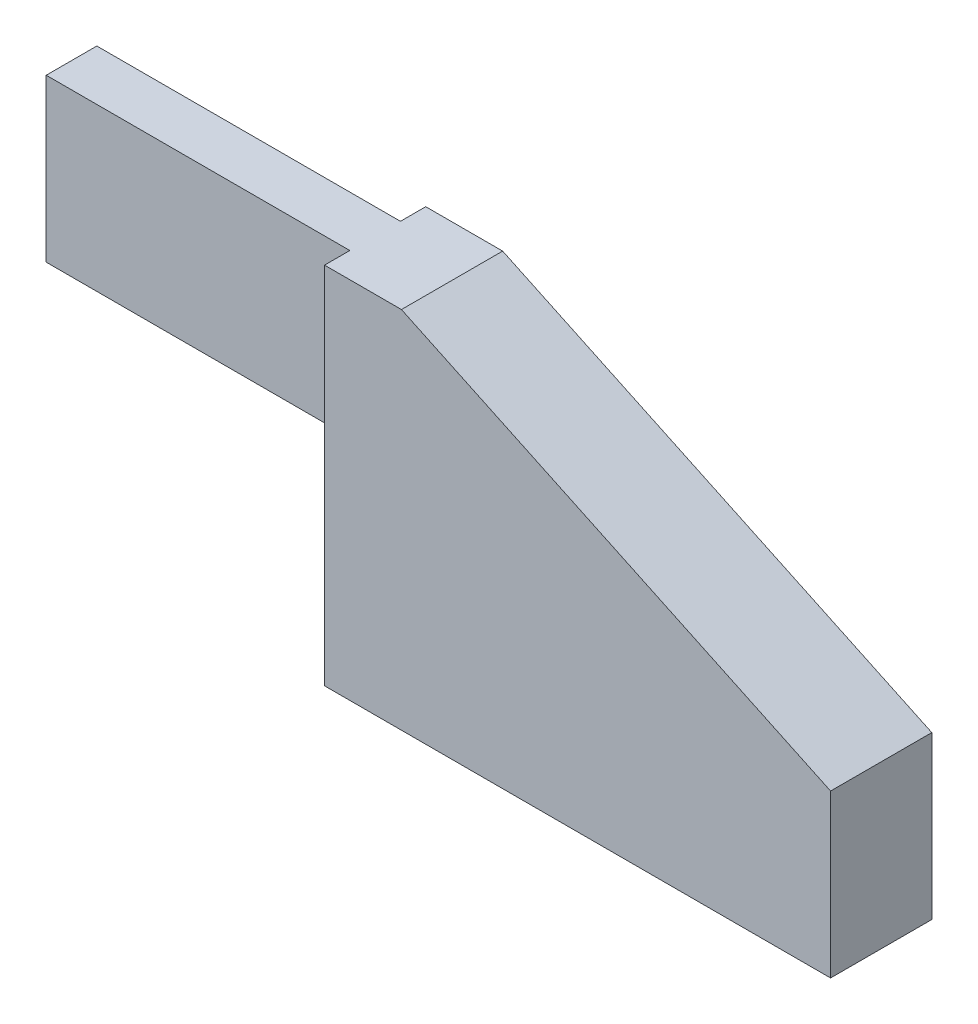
ISO-10303-21;
HEADER;
FILE_DESCRIPTION(('STEP AP214'),'2;1');
FILE_NAME('part.step','',(''),(''),'','','');
FILE_SCHEMA(('AUTOMOTIVE_DESIGN { 1 0 10303 214 1 1 1 1 }'));
ENDSEC;
DATA;
#1=APPLICATION_CONTEXT('core data for automotive mechanical design processes');
#2=APPLICATION_PROTOCOL_DEFINITION('international standard','automotive_design',2000,#1);
#3=PRODUCT_CONTEXT('',#1,'mechanical');
#4=PRODUCT('Part','Part','',(#3));
#5=PRODUCT_RELATED_PRODUCT_CATEGORY('part','',(#4));
#6=PRODUCT_DEFINITION_FORMATION('','',#4);
#7=PRODUCT_DEFINITION_CONTEXT('part definition',#1,'design');
#8=PRODUCT_DEFINITION('design','',#6,#7);
#9=PRODUCT_DEFINITION_SHAPE('','',#8);
#10=(LENGTH_UNIT() NAMED_UNIT(*) SI_UNIT(.MILLI.,.METRE.));
#11=(NAMED_UNIT(*) PLANE_ANGLE_UNIT() SI_UNIT($,.RADIAN.));
#12=(NAMED_UNIT(*) SI_UNIT($,.STERADIAN.) SOLID_ANGLE_UNIT());
#13=UNCERTAINTY_MEASURE_WITH_UNIT(LENGTH_MEASURE(1.E-05),#10,'distance_accuracy_value','');
#14=(GEOMETRIC_REPRESENTATION_CONTEXT(3) GLOBAL_UNCERTAINTY_ASSIGNED_CONTEXT((#13)) GLOBAL_UNIT_ASSIGNED_CONTEXT((#10,
#11,#12)) REPRESENTATION_CONTEXT('',''));
#15=CARTESIAN_POINT('',(0.,0.,0.));
#16=DIRECTION('',(0.,0.,1.));
#17=DIRECTION('',(1.,0.,0.));
#18=AXIS2_PLACEMENT_3D('',#15,#16,#17);
#19=CARTESIAN_POINT('',(0.,20.32,12.7));
#20=DIRECTION('',(-1.,0.,0.));
#21=DIRECTION('',(0.,-1.,0.));
#22=AXIS2_PLACEMENT_3D('',#19,#20,#21);
#23=PLANE('',#22);
#24=DIRECTION('',(0.,1.,0.));
#25=VECTOR('',#24,1.);
#26=CARTESIAN_POINT('',(0.,20.32,0.));
#27=LINE('',#26,#25);
#28=CARTESIAN_POINT('',(0.,0.,0.));
#29=VERTEX_POINT('',#28);
#30=CARTESIAN_POINT('',(0.,20.32,0.));
#31=VERTEX_POINT('',#30);
#32=EDGE_CURVE('E152',#29,#31,#27,.T.);
#33=ORIENTED_EDGE('',*,*,#32,.T.);
#34=DIRECTION('',(0.,0.,-1.));
#35=VECTOR('',#34,1.);
#36=CARTESIAN_POINT('',(0.,20.32,12.7));
#37=LINE('',#36,#35);
#38=CARTESIAN_POINT('',(0.,20.32,12.7));
#39=VERTEX_POINT('',#38);
#40=EDGE_CURVE('E11',#39,#31,#37,.T.);
#41=ORIENTED_EDGE('',*,*,#40,.F.);
#42=DIRECTION('',(0.,1.,0.));
#43=VECTOR('',#42,1.);
#44=CARTESIAN_POINT('',(0.,20.32,12.7));
#45=LINE('',#44,#43);
#46=CARTESIAN_POINT('',(0.,0.,12.7));
#47=VERTEX_POINT('',#46);
#48=EDGE_CURVE('E154',#47,#39,#45,.T.);
#49=ORIENTED_EDGE('',*,*,#48,.F.);
#50=DIRECTION('',(0.,0.,-1.));
#51=VECTOR('',#50,1.);
#52=CARTESIAN_POINT('',(0.,0.,12.7));
#53=LINE('',#52,#51);
#54=EDGE_CURVE('E163',#47,#29,#53,.T.);
#55=ORIENTED_EDGE('',*,*,#54,.T.);
#56=EDGE_LOOP('',(#33,#41,#49,#55));
#57=FACE_BOUND('',#56,.T.);
#58=ADVANCED_FACE('F34',(#57),#23,.F.);
#59=CARTESIAN_POINT('',(-53.848,45.72,12.7));
#60=DIRECTION('',(-0.426618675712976,-0.90443159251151,0.));
#61=DIRECTION('',(0.90443159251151,-0.426618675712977,0.));
#62=AXIS2_PLACEMENT_3D('',#59,#60,#61);
#63=PLANE('',#62);
#64=DIRECTION('',(-0.90443159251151,0.426618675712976,0.));
#65=VECTOR('',#64,1.);
#66=CARTESIAN_POINT('',(-53.848,45.72,0.));
#67=LINE('',#66,#65);
#68=CARTESIAN_POINT('',(-53.848,45.72,0.));
#69=VERTEX_POINT('',#68);
#70=EDGE_CURVE('E166',#31,#69,#67,.T.);
#71=ORIENTED_EDGE('',*,*,#70,.T.);
#72=DIRECTION('',(0.,0.,-1.));
#73=VECTOR('',#72,1.);
#74=CARTESIAN_POINT('',(-53.848,45.72,12.7));
#75=LINE('',#74,#73);
#76=CARTESIAN_POINT('',(-53.848,45.72,12.7));
#77=VERTEX_POINT('',#76);
#78=EDGE_CURVE('E41',#77,#69,#75,.T.);
#79=ORIENTED_EDGE('',*,*,#78,.F.);
#80=DIRECTION('',(-0.90443159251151,0.426618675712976,0.));
#81=VECTOR('',#80,1.);
#82=CARTESIAN_POINT('',(-53.848,45.72,12.7));
#83=LINE('',#82,#81);
#84=EDGE_CURVE('E83',#39,#77,#83,.T.);
#85=ORIENTED_EDGE('',*,*,#84,.F.);
#86=ORIENTED_EDGE('',*,*,#40,.T.);
#87=EDGE_LOOP('',(#71,#79,#85,#86));
#88=FACE_BOUND('',#87,.T.);
#89=ADVANCED_FACE('F183',(#88),#63,.F.);
#90=CARTESIAN_POINT('',(-101.6,45.72,12.7));
#91=DIRECTION('',(0.,-1.,0.));
#92=DIRECTION('',(0.,0.,-1.));
#93=AXIS2_PLACEMENT_3D('',#90,#91,#92);
#94=PLANE('',#93);
#95=DIRECTION('',(0.,0.,1.));
#96=VECTOR('',#95,1.);
#97=CARTESIAN_POINT('',(-63.5,45.72,3.175));
#98=LINE('',#97,#96);
#99=CARTESIAN_POINT('',(-63.5,45.72,0.));
#100=VERTEX_POINT('',#99);
#101=CARTESIAN_POINT('',(-63.5,45.72,3.175));
#102=VERTEX_POINT('',#101);
#103=EDGE_CURVE('E116',#100,#102,#98,.T.);
#104=ORIENTED_EDGE('',*,*,#103,.T.);
#105=DIRECTION('',(-1.,0.,0.));
#106=VECTOR('',#105,1.);
#107=CARTESIAN_POINT('',(-101.6,45.72,3.175));
#108=LINE('',#107,#106);
#109=CARTESIAN_POINT('',(-101.6,45.72,3.175));
#110=VERTEX_POINT('',#109);
#111=EDGE_CURVE('E123',#102,#110,#108,.T.);
#112=ORIENTED_EDGE('',*,*,#111,.T.);
#113=DIRECTION('',(0.,0.,-1.));
#114=VECTOR('',#113,1.);
#115=CARTESIAN_POINT('',(-101.6,45.72,12.7));
#116=LINE('',#115,#114);
#117=CARTESIAN_POINT('',(-101.6,45.72,9.525));
#118=VERTEX_POINT('',#117);
#119=EDGE_CURVE('E178',#118,#110,#116,.T.);
#120=ORIENTED_EDGE('',*,*,#119,.F.);
#121=DIRECTION('',(1.,0.,0.));
#122=VECTOR('',#121,1.);
#123=CARTESIAN_POINT('',(-101.6,45.72,9.525));
#124=LINE('',#123,#122);
#125=CARTESIAN_POINT('',(-63.5,45.72,9.525));
#126=VERTEX_POINT('',#125);
#127=EDGE_CURVE('E141',#118,#126,#124,.T.);
#128=ORIENTED_EDGE('',*,*,#127,.T.);
#129=DIRECTION('',(0.,0.,1.));
#130=VECTOR('',#129,1.);
#131=CARTESIAN_POINT('',(-63.5,45.72,12.7));
#132=LINE('',#131,#130);
#133=CARTESIAN_POINT('',(-63.5,45.72,12.7));
#134=VERTEX_POINT('',#133);
#135=EDGE_CURVE('E144',#126,#134,#132,.T.);
#136=ORIENTED_EDGE('',*,*,#135,.T.);
#137=DIRECTION('',(-1.,0.,0.));
#138=VECTOR('',#137,1.);
#139=CARTESIAN_POINT('',(-101.6,45.72,12.7));
#140=LINE('',#139,#138);
#141=EDGE_CURVE('E157',#77,#134,#140,.T.);
#142=ORIENTED_EDGE('',*,*,#141,.F.);
#143=ORIENTED_EDGE('',*,*,#78,.T.);
#144=DIRECTION('',(-1.,0.,0.));
#145=VECTOR('',#144,1.);
#146=CARTESIAN_POINT('',(-101.6,45.72,0.));
#147=LINE('',#146,#145);
#148=EDGE_CURVE('E134',#69,#100,#147,.T.);
#149=ORIENTED_EDGE('',*,*,#148,.T.);
#150=EDGE_LOOP('',(#104,#112,#120,#128,#136,#142,#143,#149));
#151=FACE_BOUND('',#150,.T.);
#152=ADVANCED_FACE('F132',(#151),#94,.F.);
#153=CARTESIAN_POINT('',(-101.6,25.4,12.7));
#154=DIRECTION('',(1.,0.,0.));
#155=DIRECTION('',(0.,0.,-1.));
#156=AXIS2_PLACEMENT_3D('',#153,#154,#155);
#157=PLANE('',#156);
#158=ORIENTED_EDGE('',*,*,#119,.T.);
#159=DIRECTION('',(0.,-1.,0.));
#160=VECTOR('',#159,1.);
#161=CARTESIAN_POINT('',(-101.6,45.72,3.175));
#162=LINE('',#161,#160);
#163=CARTESIAN_POINT('',(-101.6,25.4,3.175));
#164=VERTEX_POINT('',#163);
#165=EDGE_CURVE('E122',#110,#164,#162,.T.);
#166=ORIENTED_EDGE('',*,*,#165,.T.);
#167=DIRECTION('',(0.,0.,-1.));
#168=VECTOR('',#167,1.);
#169=CARTESIAN_POINT('',(-101.6,25.4,12.7));
#170=LINE('',#169,#168);
#171=CARTESIAN_POINT('',(-101.6,25.4,9.525));
#172=VERTEX_POINT('',#171);
#173=EDGE_CURVE('E175',#172,#164,#170,.T.);
#174=ORIENTED_EDGE('',*,*,#173,.F.);
#175=DIRECTION('',(0.,-1.,0.));
#176=VECTOR('',#175,1.);
#177=CARTESIAN_POINT('',(-101.6,45.72,9.525));
#178=LINE('',#177,#176);
#179=EDGE_CURVE('E147',#118,#172,#178,.T.);
#180=ORIENTED_EDGE('',*,*,#179,.F.);
#181=EDGE_LOOP('',(#158,#166,#174,#180));
#182=FACE_BOUND('',#181,.T.);
#183=ADVANCED_FACE('F207',(#182),#157,.F.);
#184=CARTESIAN_POINT('',(-63.5,25.4,12.7));
#185=DIRECTION('',(0.,1.,0.));
#186=DIRECTION('',(-1.,0.,0.));
#187=AXIS2_PLACEMENT_3D('',#184,#185,#186);
#188=PLANE('',#187);
#189=ORIENTED_EDGE('',*,*,#173,.T.);
#190=DIRECTION('',(-1.,0.,0.));
#191=VECTOR('',#190,1.);
#192=CARTESIAN_POINT('',(-101.6,25.4,3.175));
#193=LINE('',#192,#191);
#194=CARTESIAN_POINT('',(-63.5,25.4,3.175));
#195=VERTEX_POINT('',#194);
#196=EDGE_CURVE('E135',#195,#164,#193,.T.);
#197=ORIENTED_EDGE('',*,*,#196,.F.);
#198=DIRECTION('',(0.,0.,-1.));
#199=VECTOR('',#198,1.);
#200=CARTESIAN_POINT('',(-63.5,25.4,12.7));
#201=LINE('',#200,#199);
#202=CARTESIAN_POINT('',(-63.5,25.4,9.525));
#203=VERTEX_POINT('',#202);
#204=EDGE_CURVE('E119',#203,#195,#201,.T.);
#205=ORIENTED_EDGE('',*,*,#204,.F.);
#206=DIRECTION('',(1.,0.,0.));
#207=VECTOR('',#206,1.);
#208=CARTESIAN_POINT('',(-101.6,25.4,9.525));
#209=LINE('',#208,#207);
#210=EDGE_CURVE('E139',#172,#203,#209,.T.);
#211=ORIENTED_EDGE('',*,*,#210,.F.);
#212=EDGE_LOOP('',(#189,#197,#205,#211));
#213=FACE_BOUND('',#212,.T.);
#214=ADVANCED_FACE('F212',(#213),#188,.F.);
#215=CARTESIAN_POINT('',(-63.5,0.,12.7));
#216=DIRECTION('',(1.,0.,0.));
#217=DIRECTION('',(0.,0.,-1.));
#218=AXIS2_PLACEMENT_3D('',#215,#216,#217);
#219=PLANE('',#218);
#220=DIRECTION('',(0.,-1.,0.));
#221=VECTOR('',#220,1.);
#222=CARTESIAN_POINT('',(-63.5,0.,0.));
#223=LINE('',#222,#221);
#224=CARTESIAN_POINT('',(-63.5,0.,0.));
#225=VERTEX_POINT('',#224);
#226=EDGE_CURVE('E48',#100,#225,#223,.T.);
#227=ORIENTED_EDGE('',*,*,#226,.T.);
#228=DIRECTION('',(0.,0.,-1.));
#229=VECTOR('',#228,1.);
#230=CARTESIAN_POINT('',(-63.5,0.,12.7));
#231=LINE('',#230,#229);
#232=CARTESIAN_POINT('',(-63.5,0.,12.7));
#233=VERTEX_POINT('',#232);
#234=EDGE_CURVE('E172',#233,#225,#231,.T.);
#235=ORIENTED_EDGE('',*,*,#234,.F.);
#236=DIRECTION('',(0.,-1.,0.));
#237=VECTOR('',#236,1.);
#238=CARTESIAN_POINT('',(-63.5,0.,12.7));
#239=LINE('',#238,#237);
#240=EDGE_CURVE('E160',#134,#233,#239,.T.);
#241=ORIENTED_EDGE('',*,*,#240,.F.);
#242=ORIENTED_EDGE('',*,*,#135,.F.);
#243=DIRECTION('',(0.,-1.,0.));
#244=VECTOR('',#243,1.);
#245=CARTESIAN_POINT('',(-63.5,45.72,9.525));
#246=LINE('',#245,#244);
#247=EDGE_CURVE('E150',#126,#203,#246,.T.);
#248=ORIENTED_EDGE('',*,*,#247,.T.);
#249=ORIENTED_EDGE('',*,*,#204,.T.);
#250=DIRECTION('',(0.,-1.,0.));
#251=VECTOR('',#250,1.);
#252=CARTESIAN_POINT('',(-63.5,45.72,3.175));
#253=LINE('',#252,#251);
#254=EDGE_CURVE('E112',#102,#195,#253,.T.);
#255=ORIENTED_EDGE('',*,*,#254,.F.);
#256=ORIENTED_EDGE('',*,*,#103,.F.);
#257=EDGE_LOOP('',(#227,#235,#241,#242,#248,#249,#255,#256));
#258=FACE_BOUND('',#257,.T.);
#259=ADVANCED_FACE('F114',(#258),#219,.F.);
#260=CARTESIAN_POINT('',(0.,0.,12.7));
#261=DIRECTION('',(0.,1.,0.));
#262=DIRECTION('',(0.,0.,1.));
#263=AXIS2_PLACEMENT_3D('',#260,#261,#262);
#264=PLANE('',#263);
#265=DIRECTION('',(1.,0.,0.));
#266=VECTOR('',#265,1.);
#267=CARTESIAN_POINT('',(0.,0.,0.));
#268=LINE('',#267,#266);
#269=EDGE_CURVE('E76',#225,#29,#268,.T.);
#270=ORIENTED_EDGE('',*,*,#269,.T.);
#271=ORIENTED_EDGE('',*,*,#54,.F.);
#272=DIRECTION('',(1.,0.,0.));
#273=VECTOR('',#272,1.);
#274=CARTESIAN_POINT('',(0.,0.,12.7));
#275=LINE('',#274,#273);
#276=EDGE_CURVE('E57',#233,#47,#275,.T.);
#277=ORIENTED_EDGE('',*,*,#276,.F.);
#278=ORIENTED_EDGE('',*,*,#234,.T.);
#279=EDGE_LOOP('',(#270,#271,#277,#278));
#280=FACE_BOUND('',#279,.T.);
#281=ADVANCED_FACE('F186',(#280),#264,.F.);
#282=CARTESIAN_POINT('',(0.,0.,12.7));
#283=DIRECTION('',(0.,0.,-1.));
#284=DIRECTION('',(-1.,0.,0.));
#285=AXIS2_PLACEMENT_3D('',#282,#283,#284);
#286=PLANE('',#285);
#287=ORIENTED_EDGE('',*,*,#141,.T.);
#288=ORIENTED_EDGE('',*,*,#240,.T.);
#289=ORIENTED_EDGE('',*,*,#276,.T.);
#290=ORIENTED_EDGE('',*,*,#48,.T.);
#291=ORIENTED_EDGE('',*,*,#84,.T.);
#292=EDGE_LOOP('',(#287,#288,#289,#290,#291));
#293=FACE_BOUND('',#292,.T.);
#294=ADVANCED_FACE('F189',(#293),#286,.F.);
#295=CARTESIAN_POINT('',(0.,0.,0.));
#296=DIRECTION('',(0.,0.,-1.));
#297=DIRECTION('',(-1.,0.,0.));
#298=AXIS2_PLACEMENT_3D('',#295,#296,#297);
#299=PLANE('',#298);
#300=ORIENTED_EDGE('',*,*,#226,.F.);
#301=ORIENTED_EDGE('',*,*,#148,.F.);
#302=ORIENTED_EDGE('',*,*,#70,.F.);
#303=ORIENTED_EDGE('',*,*,#32,.F.);
#304=ORIENTED_EDGE('',*,*,#269,.F.);
#305=EDGE_LOOP('',(#300,#301,#302,#303,#304));
#306=FACE_BOUND('',#305,.T.);
#307=ADVANCED_FACE('F180',(#306),#299,.T.);
#308=CARTESIAN_POINT('',(-101.6,45.72,9.525));
#309=DIRECTION('',(0.,0.,-1.));
#310=DIRECTION('',(-1.,0.,0.));
#311=AXIS2_PLACEMENT_3D('',#308,#309,#310);
#312=PLANE('',#311);
#313=ORIENTED_EDGE('',*,*,#210,.T.);
#314=ORIENTED_EDGE('',*,*,#247,.F.);
#315=ORIENTED_EDGE('',*,*,#127,.F.);
#316=ORIENTED_EDGE('',*,*,#179,.T.);
#317=EDGE_LOOP('',(#313,#314,#315,#316));
#318=FACE_BOUND('',#317,.T.);
#319=ADVANCED_FACE('F196',(#318),#312,.F.);
#320=CARTESIAN_POINT('',(-101.6,45.72,3.175));
#321=DIRECTION('',(0.,0.,1.));
#322=DIRECTION('',(1.,0.,0.));
#323=AXIS2_PLACEMENT_3D('',#320,#321,#322);
#324=PLANE('',#323);
#325=ORIENTED_EDGE('',*,*,#196,.T.);
#326=ORIENTED_EDGE('',*,*,#165,.F.);
#327=ORIENTED_EDGE('',*,*,#111,.F.);
#328=ORIENTED_EDGE('',*,*,#254,.T.);
#329=EDGE_LOOP('',(#325,#326,#327,#328));
#330=FACE_BOUND('',#329,.T.);
#331=ADVANCED_FACE('F126',(#330),#324,.F.);
#332=CLOSED_SHELL('',(#58,#89,#152,#183,#214,#259,#281,#294,#307,#319,#331));
#333=MANIFOLD_SOLID_BREP('B2',#332);
#334=ADVANCED_BREP_SHAPE_REPRESENTATION('',(#18,#333),#14);
#335=SHAPE_DEFINITION_REPRESENTATION(#9,#334);
ENDSEC;
END-ISO-10303-21;
